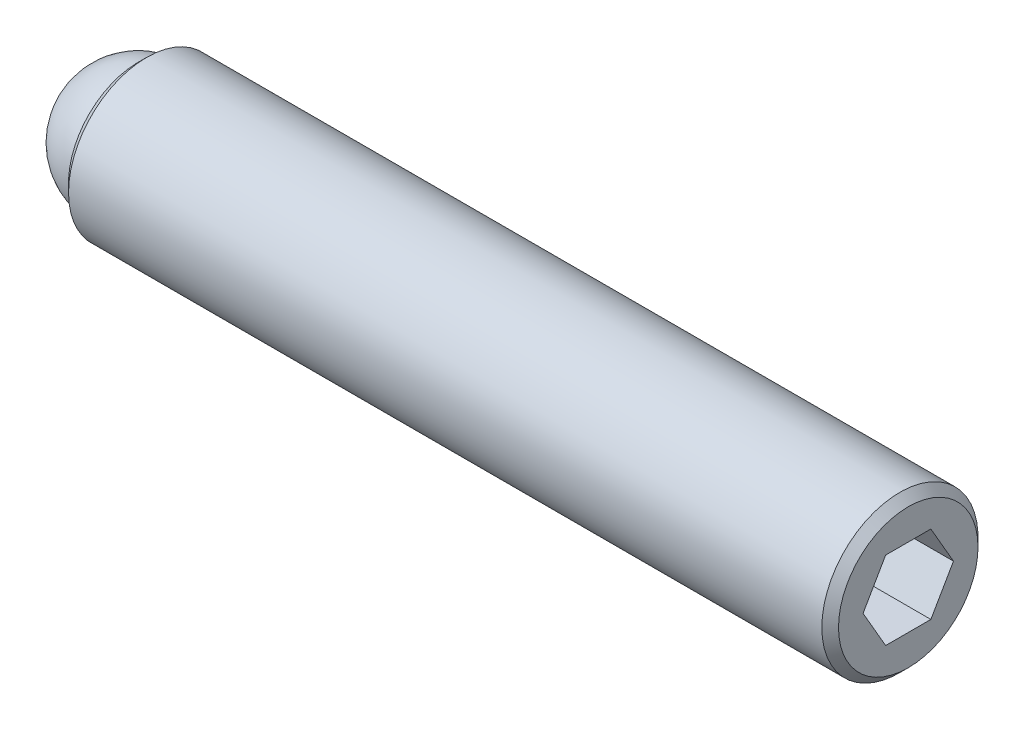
from build123d import *

# Parameters (mm, degrees)
SKETCH2_R           = 2.3749
BOSS_EXTRUDE1_DEPTH = 23.415625
CHAMFER1_SIZE       = 0.254
CHAMFER2_SIZE       = 0.254
CUT_EXTRUDE2_DEPTH  = 2.286
SKETCH3_R           = 1.9812
CUT_EXTRUDE3_DEPTH  = 1.984375


with BuildPart() as part:
    # Sketch2 → Boss-Extrude1 (new body)
    with BuildSketch(Plane(origin=(0, 0, 0), x_dir=(0, 0, -1), z_dir=(1, 0, 0))):
        with Locations(Location((0, 0, 0), (0, 0, 180))):
            Circle(SKETCH2_R)
    extrude(amount=BOSS_EXTRUDE1_DEPTH)

    # Chamfer1
    chamfer1_edges = [part.edges().sort_by_distance(p)[0] for p in [
        (0, 0, -2.3749),
    ]]
    chamfer(chamfer1_edges, length=CHAMFER1_SIZE)

    # Chamfer2
    chamfer2_edges = [part.edges().sort_by_distance(p)[0] for p in [
        (23.415625, 0, -2.3749),
    ]]
    chamfer(chamfer2_edges, length=CHAMFER2_SIZE)

    # Sketch4 → Cut-Extrude2 (cut)
    with BuildSketch(Plane(origin=(23.415625, 0, 0), x_dir=(0, 0, -1), z_dir=(1, 0, 0))):
        Polygon((1.374815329, 0), (0.687407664, 1.190625), (-0.687407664, 1.190625), (-1.374815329, 0), (-0.687407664, -1.190625), (0.687407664, -1.190625), align=None)
    extrude(amount=-CUT_EXTRUDE2_DEPTH, mode=Mode.SUBTRACT)

    # Sketch3 → Cut-Extrude3 (cut)
    with BuildSketch(Plane.ZY):
        Circle(SKETCH3_R)
    extrude(amount=-CUT_EXTRUDE3_DEPTH, mode=Mode.SUBTRACT)


with BuildPart() as body_2:
    # Sketch5 → Revolve1 (revolve)
    with BuildSketch(Plane.ZY):
        with BuildLine():
            Line((0, 0), (0, -1.984375))
            ThreePointArc((0, -1.984375), (-1.984375, 0), (0, 1.984375))
            Line((0, 1.984375), (0, 0))
        make_face()
    revolve(axis=Axis((0, 0, 0), (0, 1, 0)))


solid = Compound([part.part, body_2.part])
